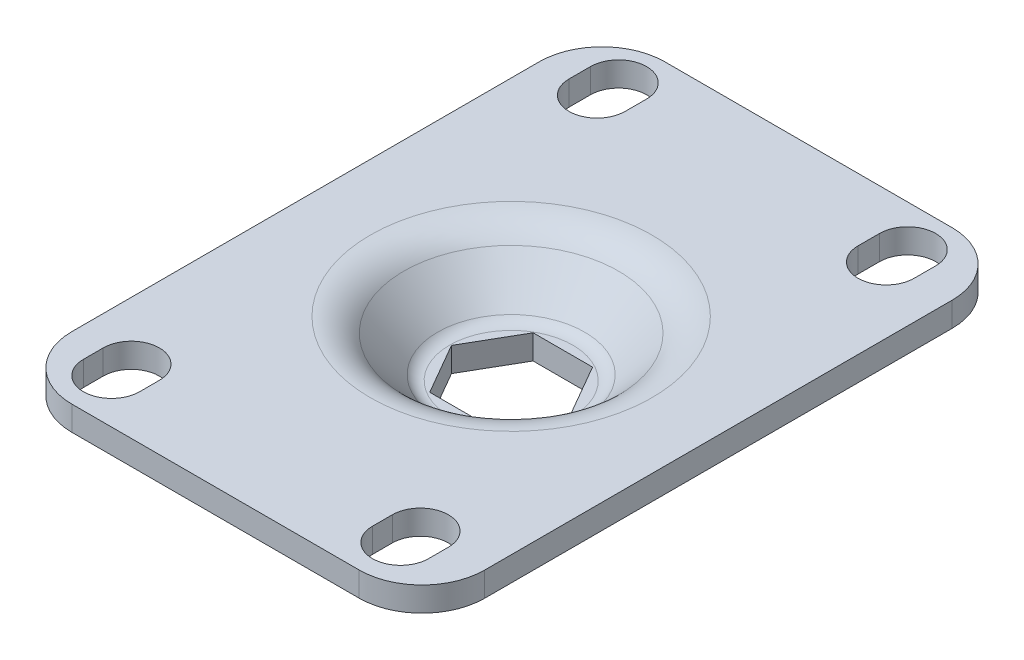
ISO-10303-21;
HEADER;
FILE_DESCRIPTION(('STEP AP214'),'2;1');
FILE_NAME('part.step','',(''),(''),'','','');
FILE_SCHEMA(('AUTOMOTIVE_DESIGN { 1 0 10303 214 1 1 1 1 }'));
ENDSEC;
DATA;
#1=APPLICATION_CONTEXT('core data for automotive mechanical design processes');
#2=APPLICATION_PROTOCOL_DEFINITION('international standard','automotive_design',2000,#1);
#3=PRODUCT_CONTEXT('',#1,'mechanical');
#4=PRODUCT('Part','Part','',(#3));
#5=PRODUCT_RELATED_PRODUCT_CATEGORY('part','',(#4));
#6=PRODUCT_DEFINITION_FORMATION('','',#4);
#7=PRODUCT_DEFINITION_CONTEXT('part definition',#1,'design');
#8=PRODUCT_DEFINITION('design','',#6,#7);
#9=PRODUCT_DEFINITION_SHAPE('','',#8);
#10=(LENGTH_UNIT() NAMED_UNIT(*) SI_UNIT(.MILLI.,.METRE.));
#11=(NAMED_UNIT(*) PLANE_ANGLE_UNIT() SI_UNIT($,.RADIAN.));
#12=(NAMED_UNIT(*) SI_UNIT($,.STERADIAN.) SOLID_ANGLE_UNIT());
#13=UNCERTAINTY_MEASURE_WITH_UNIT(LENGTH_MEASURE(1.E-05),#10,'distance_accuracy_value','');
#14=(GEOMETRIC_REPRESENTATION_CONTEXT(3) GLOBAL_UNCERTAINTY_ASSIGNED_CONTEXT((#13)) GLOBAL_UNIT_ASSIGNED_CONTEXT((#10,
#11,#12)) REPRESENTATION_CONTEXT('',''));
#15=CARTESIAN_POINT('',(0.,0.,0.));
#16=DIRECTION('',(0.,0.,1.));
#17=DIRECTION('',(1.,0.,0.));
#18=AXIS2_PLACEMENT_3D('',#15,#16,#17);
#19=CARTESIAN_POINT('',(9.46750689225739,0.,0.));
#20=DIRECTION('',(0.,-1.,0.));
#21=DIRECTION('',(0.,0.,-1.));
#22=AXIS2_PLACEMENT_3D('',#19,#20,#21);
#23=PLANE('',#22);
#24=DIRECTION('',(1.,0.,0.));
#25=VECTOR('',#24,1.);
#26=CARTESIAN_POINT('',(-4.70977858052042,0.,7.81482388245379));
#27=LINE('',#26,#25);
#28=CARTESIAN_POINT('',(4.47640557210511,0.,7.81482388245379));
#29=VERTEX_POINT('',#28);
#30=CARTESIAN_POINT('',(-4.70977858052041,0.,7.81482388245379));
#31=VERTEX_POINT('',#30);
#32=EDGE_CURVE('E735',#29,#31,#27,.F.);
#33=ORIENTED_EDGE('',*,*,#32,.T.);
#34=DIRECTION('',(0.500000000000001,0.,0.866025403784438));
#35=VECTOR('',#34,1.);
#36=CARTESIAN_POINT('',(-9.28212202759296,0.,-0.104707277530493));
#37=LINE('',#36,#35);
#38=CARTESIAN_POINT('',(-9.28212202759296,0.,-0.104707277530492));
#39=VERTEX_POINT('',#38);
#40=EDGE_CURVE('E240',#31,#39,#37,.F.);
#41=ORIENTED_EDGE('',*,*,#40,.T.);
#42=DIRECTION('',(-0.500000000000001,0.,0.866025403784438));
#43=VECTOR('',#42,1.);
#44=CARTESIAN_POINT('',(-4.68902995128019,0.,-8.06017611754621));
#45=LINE('',#44,#43);
#46=CARTESIAN_POINT('',(-4.68902995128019,0.,-8.06017611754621));
#47=VERTEX_POINT('',#46);
#48=EDGE_CURVE('E235',#39,#47,#45,.F.);
#49=ORIENTED_EDGE('',*,*,#48,.T.);
#50=DIRECTION('',(-1.,0.,0.));
#51=VECTOR('',#50,1.);
#52=CARTESIAN_POINT('',(4.45565694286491,0.,-8.06017611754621));
#53=LINE('',#52,#51);
#54=CARTESIAN_POINT('',(4.45565694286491,0.,-8.06017611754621));
#55=VERTEX_POINT('',#54);
#56=EDGE_CURVE('E225',#47,#55,#53,.F.);
#57=ORIENTED_EDGE('',*,*,#56,.T.);
#58=DIRECTION('',(-0.5,0.,-0.866025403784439));
#59=VECTOR('',#58,1.);
#60=CARTESIAN_POINT('',(9.04874901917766,0.,-0.104707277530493));
#61=LINE('',#60,#59);
#62=CARTESIAN_POINT('',(9.04874901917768,0.,-0.104707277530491));
#63=VERTEX_POINT('',#62);
#64=EDGE_CURVE('E249',#55,#63,#61,.F.);
#65=ORIENTED_EDGE('',*,*,#64,.T.);
#66=DIRECTION('',(0.5,0.,-0.866025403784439));
#67=VECTOR('',#66,1.);
#68=CARTESIAN_POINT('',(4.47640557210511,0.,7.81482388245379));
#69=LINE('',#68,#67);
#70=EDGE_CURVE('E740',#63,#29,#69,.F.);
#71=ORIENTED_EDGE('',*,*,#70,.T.);
#72=EDGE_LOOP('',(#33,#41,#49,#57,#65,#71));
#73=FACE_BOUND('',#72,.T.);
#74=CARTESIAN_POINT('',(0.,0.,0.));
#75=DIRECTION('',(0.,-1.,0.));
#76=DIRECTION('',(-1.,0.,0.));
#77=AXIS2_PLACEMENT_3D('',#74,#75,#76);
#78=CIRCLE('',#77,9.46750689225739);
#79=CARTESIAN_POINT('',(-9.46750689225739,0.,0.));
#80=VERTEX_POINT('',#79);
#81=EDGE_CURVE('E244',#80,#80,#78,.F.);
#82=ORIENTED_EDGE('',*,*,#81,.T.);
#83=EDGE_LOOP('',(#82));
#84=FACE_BOUND('',#83,.T.);
#85=ADVANCED_FACE('F16',(#73,#84),#23,.F.);
#86=CARTESIAN_POINT('',(0.,2.54,0.));
#87=DIRECTION('',(0.,1.,0.));
#88=DIRECTION('',(0.,0.,1.));
#89=AXIS2_PLACEMENT_3D('',#86,#87,#88);
#90=TOROIDAL_SURFACE('',#89,9.46750689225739,2.54);
#91=CARTESIAN_POINT('',(0.,0.800927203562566,0.));
#92=DIRECTION('',(0.,1.,0.));
#93=DIRECTION('',(-1.,0.,0.));
#94=AXIS2_PLACEMENT_3D('',#91,#92,#93);
#95=CIRCLE('',#94,11.3187837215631);
#96=CARTESIAN_POINT('',(-11.3187837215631,0.800927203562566,0.));
#97=VERTEX_POINT('',#96);
#98=EDGE_CURVE('E718',#97,#97,#95,.T.);
#99=ORIENTED_EDGE('',*,*,#98,.T.);
#100=EDGE_LOOP('',(#99));
#101=FACE_BOUND('',#100,.T.);
#102=ORIENTED_EDGE('',*,*,#81,.F.);
#103=EDGE_LOOP('',(#102));
#104=FACE_BOUND('',#103,.T.);
#105=ADVANCED_FACE('F258',(#101,#104),#90,.F.);
#106=CARTESIAN_POINT('',(-4.68902995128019,8.55980011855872,-8.06017611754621));
#107=DIRECTION('',(-0.866025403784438,0.,-0.500000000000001));
#108=DIRECTION('',(-0.500000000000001,0.,0.866025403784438));
#109=AXIS2_PLACEMENT_3D('',#106,#107,#108);
#110=PLANE('',#109);
#111=DIRECTION('',(0.500000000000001,0.,-0.866025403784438));
#112=VECTOR('',#111,1.);
#113=CARTESIAN_POINT('',(-9.28212202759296,-3.75919988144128,-0.104707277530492));
#114=LINE('',#113,#112);
#115=CARTESIAN_POINT('',(-9.28212202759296,-3.75919988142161,-0.104707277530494));
#116=VERTEX_POINT('',#115);
#117=CARTESIAN_POINT('',(-4.68902995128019,-3.75919988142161,-8.06017611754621));
#118=VERTEX_POINT('',#117);
#119=EDGE_CURVE('E248',#116,#118,#114,.T.);
#120=ORIENTED_EDGE('',*,*,#119,.T.);
#121=DIRECTION('',(0.,1.,0.));
#122=VECTOR('',#121,1.);
#123=CARTESIAN_POINT('',(-4.68902995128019,8.55980011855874,-8.06017611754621));
#124=LINE('',#123,#122);
#125=EDGE_CURVE('E230',#118,#47,#124,.T.);
#126=ORIENTED_EDGE('',*,*,#125,.T.);
#127=ORIENTED_EDGE('',*,*,#48,.F.);
#128=DIRECTION('',(0.,1.,0.));
#129=VECTOR('',#128,1.);
#130=CARTESIAN_POINT('',(-9.28212202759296,8.55980011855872,-0.104707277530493));
#131=LINE('',#130,#129);
#132=EDGE_CURVE('E729',#39,#116,#131,.F.);
#133=ORIENTED_EDGE('',*,*,#132,.T.);
#134=EDGE_LOOP('',(#120,#126,#127,#133));
#135=FACE_BOUND('',#134,.T.);
#136=ADVANCED_FACE('F247',(#135),#110,.F.);
#137=CARTESIAN_POINT('',(4.45565694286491,8.55980011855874,-8.06017611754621));
#138=DIRECTION('',(0.,0.,-1.));
#139=DIRECTION('',(-1.,0.,0.));
#140=AXIS2_PLACEMENT_3D('',#137,#138,#139);
#141=PLANE('',#140);
#142=DIRECTION('',(1.,0.,0.));
#143=VECTOR('',#142,1.);
#144=CARTESIAN_POINT('',(4.87651302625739,-3.75919988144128,-8.06017611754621));
#145=LINE('',#144,#143);
#146=CARTESIAN_POINT('',(4.45565694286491,-3.75919988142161,-8.06017611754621));
#147=VERTEX_POINT('',#146);
#148=EDGE_CURVE('E753',#118,#147,#145,.T.);
#149=ORIENTED_EDGE('',*,*,#148,.T.);
#150=DIRECTION('',(0.,1.,0.));
#151=VECTOR('',#150,1.);
#152=CARTESIAN_POINT('',(4.45565694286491,8.55980011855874,-8.06017611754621));
#153=LINE('',#152,#151);
#154=EDGE_CURVE('E232',#147,#55,#153,.T.);
#155=ORIENTED_EDGE('',*,*,#154,.T.);
#156=ORIENTED_EDGE('',*,*,#56,.F.);
#157=ORIENTED_EDGE('',*,*,#125,.F.);
#158=EDGE_LOOP('',(#149,#155,#156,#157));
#159=FACE_BOUND('',#158,.T.);
#160=ADVANCED_FACE('F228',(#159),#141,.F.);
#161=CARTESIAN_POINT('',(9.04874901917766,8.55980011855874,-0.104707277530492));
#162=DIRECTION('',(0.866025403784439,0.,-0.5));
#163=DIRECTION('',(-0.5,0.,-0.866025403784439));
#164=AXIS2_PLACEMENT_3D('',#161,#162,#163);
#165=PLANE('',#164);
#166=DIRECTION('',(0.500000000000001,0.,0.866025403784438));
#167=VECTOR('',#166,1.);
#168=CARTESIAN_POINT('',(4.45565694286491,-3.75919988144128,-8.06017611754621));
#169=LINE('',#168,#167);
#170=CARTESIAN_POINT('',(9.04874901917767,-3.75919988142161,-0.104707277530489));
#171=VERTEX_POINT('',#170);
#172=EDGE_CURVE('E750',#147,#171,#169,.T.);
#173=ORIENTED_EDGE('',*,*,#172,.T.);
#174=DIRECTION('',(0.,1.,0.));
#175=VECTOR('',#174,1.);
#176=CARTESIAN_POINT('',(9.04874901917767,8.55980011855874,-0.104707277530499));
#177=LINE('',#176,#175);
#178=EDGE_CURVE('E737',#171,#63,#177,.T.);
#179=ORIENTED_EDGE('',*,*,#178,.T.);
#180=ORIENTED_EDGE('',*,*,#64,.F.);
#181=ORIENTED_EDGE('',*,*,#154,.F.);
#182=EDGE_LOOP('',(#173,#179,#180,#181));
#183=FACE_BOUND('',#182,.T.);
#184=ADVANCED_FACE('F472',(#183),#165,.F.);
#185=CARTESIAN_POINT('',(4.47640557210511,8.55980011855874,7.81482388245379));
#186=DIRECTION('',(0.866025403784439,0.,0.5));
#187=DIRECTION('',(0.5,0.,-0.866025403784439));
#188=AXIS2_PLACEMENT_3D('',#185,#186,#187);
#189=PLANE('',#188);
#190=DIRECTION('',(-0.500000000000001,0.,0.866025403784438));
#191=VECTOR('',#190,1.);
#192=CARTESIAN_POINT('',(9.04874901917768,-3.75919988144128,-0.104707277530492));
#193=LINE('',#192,#191);
#194=CARTESIAN_POINT('',(4.47640557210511,-3.75919988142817,7.81482388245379));
#195=VERTEX_POINT('',#194);
#196=EDGE_CURVE('E744',#171,#195,#193,.T.);
#197=ORIENTED_EDGE('',*,*,#196,.T.);
#198=DIRECTION('',(0.,1.,0.));
#199=VECTOR('',#198,1.);
#200=CARTESIAN_POINT('',(4.47640557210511,8.55980011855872,7.81482388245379));
#201=LINE('',#200,#199);
#202=EDGE_CURVE('E732',#195,#29,#201,.T.);
#203=ORIENTED_EDGE('',*,*,#202,.T.);
#204=ORIENTED_EDGE('',*,*,#70,.F.);
#205=ORIENTED_EDGE('',*,*,#178,.F.);
#206=EDGE_LOOP('',(#197,#203,#204,#205));
#207=FACE_BOUND('',#206,.T.);
#208=ADVANCED_FACE('F468',(#207),#189,.F.);
#209=CARTESIAN_POINT('',(-4.70977858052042,8.55980011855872,7.81482388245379));
#210=DIRECTION('',(0.,0.,1.));
#211=DIRECTION('',(1.,0.,0.));
#212=AXIS2_PLACEMENT_3D('',#209,#210,#211);
#213=PLANE('',#212);
#214=DIRECTION('',(1.,0.,0.));
#215=VECTOR('',#214,1.);
#216=CARTESIAN_POINT('',(4.87651302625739,-3.75919988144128,7.81482388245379));
#217=LINE('',#216,#215);
#218=CARTESIAN_POINT('',(-4.70977858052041,-3.75919988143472,7.81482388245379));
#219=VERTEX_POINT('',#218);
#220=EDGE_CURVE('E747',#195,#219,#217,.F.);
#221=ORIENTED_EDGE('',*,*,#220,.T.);
#222=DIRECTION('',(0.,1.,0.));
#223=VECTOR('',#222,1.);
#224=CARTESIAN_POINT('',(-4.7097785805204,8.55980011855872,7.81482388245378));
#225=LINE('',#224,#223);
#226=EDGE_CURVE('E190',#219,#31,#225,.T.);
#227=ORIENTED_EDGE('',*,*,#226,.T.);
#228=ORIENTED_EDGE('',*,*,#32,.F.);
#229=ORIENTED_EDGE('',*,*,#202,.F.);
#230=EDGE_LOOP('',(#221,#227,#228,#229));
#231=FACE_BOUND('',#230,.T.);
#232=ADVANCED_FACE('F465',(#231),#213,.F.);
#233=CARTESIAN_POINT('',(-9.28212202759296,8.55980011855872,-0.104707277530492));
#234=DIRECTION('',(-0.866025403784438,0.,0.500000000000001));
#235=DIRECTION('',(0.500000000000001,0.,0.866025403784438));
#236=AXIS2_PLACEMENT_3D('',#233,#234,#235);
#237=PLANE('',#236);
#238=DIRECTION('',(-0.499999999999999,0.,-0.866025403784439));
#239=VECTOR('',#238,1.);
#240=CARTESIAN_POINT('',(-4.70977858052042,-3.75919988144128,7.81482388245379));
#241=LINE('',#240,#239);
#242=EDGE_CURVE('E427',#219,#116,#241,.T.);
#243=ORIENTED_EDGE('',*,*,#242,.T.);
#244=ORIENTED_EDGE('',*,*,#132,.F.);
#245=ORIENTED_EDGE('',*,*,#40,.F.);
#246=ORIENTED_EDGE('',*,*,#226,.F.);
#247=EDGE_LOOP('',(#243,#244,#245,#246));
#248=FACE_BOUND('',#247,.T.);
#249=ADVANCED_FACE('F461',(#248),#237,.F.);
#250=CARTESIAN_POINT('',(0.,6.33322245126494,0.));
#251=DIRECTION('',(0.,1.,0.));
#252=DIRECTION('',(0.,0.,1.));
#253=AXIS2_PLACEMENT_3D('',#250,#251,#252);
#254=CONICAL_SURFACE('',#253,16.5157720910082,0.754156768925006);
#255=CARTESIAN_POINT('',(0.,6.33322245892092,0.));
#256=DIRECTION('',(0.,1.,0.));
#257=DIRECTION('',(0.,0.,1.));
#258=AXIS2_PLACEMENT_3D('',#255,#256,#257);
#259=CIRCLE('',#258,16.5157720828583);
#260=CARTESIAN_POINT('',(0.,6.33322245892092,16.5157720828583));
#261=VERTEX_POINT('',#260);
#262=EDGE_CURVE('E423',#261,#261,#259,.F.);
#263=ORIENTED_EDGE('',*,*,#262,.F.);
#264=EDGE_LOOP('',(#263));
#265=FACE_BOUND('',#264,.T.);
#266=ORIENTED_EDGE('',*,*,#98,.F.);
#267=EDGE_LOOP('',(#266));
#268=FACE_BOUND('',#267,.T.);
#269=ADVANCED_FACE('F457',(#265,#268),#254,.F.);
#270=CARTESIAN_POINT('',(4.87651302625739,-3.75919988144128,0.));
#271=DIRECTION('',(0.,1.,0.));
#272=DIRECTION('',(0.,0.,1.));
#273=AXIS2_PLACEMENT_3D('',#270,#271,#272);
#274=PLANE('',#273);
#275=ORIENTED_EDGE('',*,*,#220,.F.);
#276=ORIENTED_EDGE('',*,*,#196,.F.);
#277=ORIENTED_EDGE('',*,*,#172,.F.);
#278=ORIENTED_EDGE('',*,*,#148,.F.);
#279=ORIENTED_EDGE('',*,*,#119,.F.);
#280=ORIENTED_EDGE('',*,*,#242,.F.);
#281=EDGE_LOOP('',(#275,#276,#277,#278,#279,#280));
#282=FACE_BOUND('',#281,.T.);
#283=CARTESIAN_POINT('',(0.,-3.75919988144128,0.));
#284=DIRECTION('',(0.,1.,0.));
#285=DIRECTION('',(-1.,0.,0.));
#286=AXIS2_PLACEMENT_3D('',#283,#284,#285);
#287=CIRCLE('',#286,11.0938686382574);
#288=CARTESIAN_POINT('',(-11.0938686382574,-3.75919988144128,0.));
#289=VERTEX_POINT('',#288);
#290=EDGE_CURVE('E426',#289,#289,#287,.T.);
#291=ORIENTED_EDGE('',*,*,#290,.F.);
#292=EDGE_LOOP('',(#291));
#293=FACE_BOUND('',#292,.T.);
#294=ADVANCED_FACE('F448',(#282,#293),#274,.F.);
#295=CARTESIAN_POINT('',(0.,1.49860011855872,0.));
#296=DIRECTION('',(0.,1.,0.));
#297=DIRECTION('',(0.,0.,1.));
#298=AXIS2_PLACEMENT_3D('',#295,#296,#297);
#299=TOROIDAL_SURFACE('',#298,21.6623216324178,7.0612);
#300=ORIENTED_EDGE('',*,*,#262,.T.);
#301=EDGE_LOOP('',(#300));
#302=FACE_BOUND('',#301,.T.);
#303=CARTESIAN_POINT('',(0.,8.55980011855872,0.));
#304=DIRECTION('',(0.,1.,0.));
#305=DIRECTION('',(-1.,0.,0.));
#306=AXIS2_PLACEMENT_3D('',#303,#304,#305);
#307=CIRCLE('',#306,21.6623216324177);
#308=CARTESIAN_POINT('',(-21.6623216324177,8.55980011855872,0.));
#309=VERTEX_POINT('',#308);
#310=EDGE_CURVE('E379',#309,#309,#307,.T.);
#311=ORIENTED_EDGE('',*,*,#310,.T.);
#312=EDGE_LOOP('',(#311));
#313=FACE_BOUND('',#312,.T.);
#314=ADVANCED_FACE('F413',(#302,#313),#299,.T.);
#315=CARTESIAN_POINT('',(0.,-1.21919988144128,0.));
#316=DIRECTION('',(0.,1.,0.));
#317=DIRECTION('',(0.,0.,1.));
#318=AXIS2_PLACEMENT_3D('',#315,#316,#317);
#319=TOROIDAL_SURFACE('',#318,11.0938686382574,2.54);
#320=CARTESIAN_POINT('',(0.,-2.9582726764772,0.));
#321=DIRECTION('',(0.,1.,0.));
#322=DIRECTION('',(-1.,0.,0.));
#323=AXIS2_PLACEMENT_3D('',#320,#321,#322);
#324=CIRCLE('',#323,12.9451454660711);
#325=CARTESIAN_POINT('',(-12.9451454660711,-2.9582726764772,0.));
#326=VERTEX_POINT('',#325);
#327=EDGE_CURVE('E375',#326,#326,#324,.T.);
#328=ORIENTED_EDGE('',*,*,#327,.F.);
#329=EDGE_LOOP('',(#328));
#330=FACE_BOUND('',#329,.T.);
#331=ORIENTED_EDGE('',*,*,#290,.T.);
#332=EDGE_LOOP('',(#331));
#333=FACE_BOUND('',#332,.T.);
#334=ADVANCED_FACE('F407',(#330,#333),#319,.T.);
#335=CARTESIAN_POINT('',(21.6623216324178,8.55980011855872,0.));
#336=DIRECTION('',(0.,-1.,0.));
#337=DIRECTION('',(0.,0.,-1.));
#338=AXIS2_PLACEMENT_3D('',#335,#336,#337);
#339=PLANE('',#338);
#340=ORIENTED_EDGE('',*,*,#310,.F.);
#341=EDGE_LOOP('',(#340));
#342=FACE_BOUND('',#341,.T.);
#343=CARTESIAN_POINT('',(21.5974591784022,8.55980011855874,35.5644755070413));
#344=DIRECTION('',(0.,-1.,0.));
#345=DIRECTION('',(0.,0.,-1.));
#346=AXIS2_PLACEMENT_3D('',#343,#344,#345);
#347=CIRCLE('',#346,4.318);
#348=CARTESIAN_POINT('',(17.2794591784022,8.55980011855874,35.5644755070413));
#349=VERTEX_POINT('',#348);
#350=CARTESIAN_POINT('',(25.9154591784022,8.55980011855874,35.5644755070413));
#351=VERTEX_POINT('',#350);
#352=EDGE_CURVE('E322',#349,#351,#347,.T.);
#353=ORIENTED_EDGE('',*,*,#352,.T.);
#354=DIRECTION('',(0.,0.,-1.));
#355=VECTOR('',#354,1.);
#356=CARTESIAN_POINT('',(25.9154591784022,8.55980011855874,35.5644755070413));
#357=LINE('',#356,#355);
#358=CARTESIAN_POINT('',(25.9154591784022,8.55980011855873,38.6124755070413));
#359=VERTEX_POINT('',#358);
#360=EDGE_CURVE('E382',#351,#359,#357,.F.);
#361=ORIENTED_EDGE('',*,*,#360,.T.);
#362=CARTESIAN_POINT('',(21.5974591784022,8.55980011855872,38.6124755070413));
#363=DIRECTION('',(0.,-1.,0.));
#364=DIRECTION('',(0.,0.,-1.));
#365=AXIS2_PLACEMENT_3D('',#362,#363,#364);
#366=CIRCLE('',#365,4.318);
#367=CARTESIAN_POINT('',(17.2794591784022,8.55980011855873,38.6124755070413));
#368=VERTEX_POINT('',#367);
#369=EDGE_CURVE('E325',#359,#368,#366,.T.);
#370=ORIENTED_EDGE('',*,*,#369,.T.);
#371=DIRECTION('',(0.,0.,1.));
#372=VECTOR('',#371,1.);
#373=CARTESIAN_POINT('',(17.2794591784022,8.55980011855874,35.5644755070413));
#374=LINE('',#373,#372);
#375=EDGE_CURVE('E394',#368,#349,#374,.F.);
#376=ORIENTED_EDGE('',*,*,#375,.T.);
#377=EDGE_LOOP('',(#353,#361,#370,#376));
#378=FACE_BOUND('',#377,.T.);
#379=CARTESIAN_POINT('',(-22.8525408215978,8.55980011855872,35.5644755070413));
#380=DIRECTION('',(0.,-1.,0.));
#381=DIRECTION('',(0.,0.,-1.));
#382=AXIS2_PLACEMENT_3D('',#379,#380,#381);
#383=CIRCLE('',#382,4.318);
#384=CARTESIAN_POINT('',(-27.1705408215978,8.55980011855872,35.5644755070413));
#385=VERTEX_POINT('',#384);
#386=CARTESIAN_POINT('',(-18.5345408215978,8.55980011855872,35.5644755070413));
#387=VERTEX_POINT('',#386);
#388=EDGE_CURVE('E329',#385,#387,#383,.T.);
#389=ORIENTED_EDGE('',*,*,#388,.T.);
#390=DIRECTION('',(0.,0.,-1.));
#391=VECTOR('',#390,1.);
#392=CARTESIAN_POINT('',(-18.5345408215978,8.55980011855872,35.5644755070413));
#393=LINE('',#392,#391);
#394=CARTESIAN_POINT('',(-18.5345408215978,8.55980011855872,38.6124755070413));
#395=VERTEX_POINT('',#394);
#396=EDGE_CURVE('E555',#387,#395,#393,.F.);
#397=ORIENTED_EDGE('',*,*,#396,.T.);
#398=CARTESIAN_POINT('',(-22.8525408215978,8.55980011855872,38.6124755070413));
#399=DIRECTION('',(0.,-1.,0.));
#400=DIRECTION('',(0.,0.,-1.));
#401=AXIS2_PLACEMENT_3D('',#398,#399,#400);
#402=CIRCLE('',#401,4.318);
#403=CARTESIAN_POINT('',(-27.1705408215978,8.55980011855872,38.6124755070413));
#404=VERTEX_POINT('',#403);
#405=EDGE_CURVE('E333',#395,#404,#402,.T.);
#406=ORIENTED_EDGE('',*,*,#405,.T.);
#407=DIRECTION('',(0.,0.,1.));
#408=VECTOR('',#407,1.);
#409=CARTESIAN_POINT('',(-27.1705408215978,8.55980011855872,35.5644755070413));
#410=LINE('',#409,#408);
#411=EDGE_CURVE('E560',#404,#385,#410,.F.);
#412=ORIENTED_EDGE('',*,*,#411,.T.);
#413=EDGE_LOOP('',(#389,#397,#406,#412));
#414=FACE_BOUND('',#413,.T.);
#415=CARTESIAN_POINT('',(-22.8525408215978,8.55980011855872,-39.3655244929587));
#416=DIRECTION('',(0.,-1.,0.));
#417=DIRECTION('',(0.,0.,-1.));
#418=AXIS2_PLACEMENT_3D('',#415,#416,#417);
#419=CIRCLE('',#418,4.318);
#420=CARTESIAN_POINT('',(-27.1705408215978,8.55980011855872,-39.3655244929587));
#421=VERTEX_POINT('',#420);
#422=CARTESIAN_POINT('',(-18.5345408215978,8.55980011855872,-39.3655244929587));
#423=VERTEX_POINT('',#422);
#424=EDGE_CURVE('E337',#421,#423,#419,.T.);
#425=ORIENTED_EDGE('',*,*,#424,.T.);
#426=DIRECTION('',(0.,0.,-1.));
#427=VECTOR('',#426,1.);
#428=CARTESIAN_POINT('',(-18.5345408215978,8.55980011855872,-39.3655244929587));
#429=LINE('',#428,#427);
#430=CARTESIAN_POINT('',(-18.5345408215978,8.55980011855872,-36.0635244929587));
#431=VERTEX_POINT('',#430);
#432=EDGE_CURVE('E565',#423,#431,#429,.F.);
#433=ORIENTED_EDGE('',*,*,#432,.T.);
#434=CARTESIAN_POINT('',(-22.8525408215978,8.55980011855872,-36.0635244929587));
#435=DIRECTION('',(0.,-1.,0.));
#436=DIRECTION('',(0.,0.,-1.));
#437=AXIS2_PLACEMENT_3D('',#434,#435,#436);
#438=CIRCLE('',#437,4.318);
#439=CARTESIAN_POINT('',(-27.1705408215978,8.55980011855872,-36.0635244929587));
#440=VERTEX_POINT('',#439);
#441=EDGE_CURVE('E341',#431,#440,#438,.T.);
#442=ORIENTED_EDGE('',*,*,#441,.T.);
#443=DIRECTION('',(0.,0.,1.));
#444=VECTOR('',#443,1.);
#445=CARTESIAN_POINT('',(-27.1705408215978,8.55980011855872,-39.3655244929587));
#446=LINE('',#445,#444);
#447=EDGE_CURVE('E570',#440,#421,#446,.F.);
#448=ORIENTED_EDGE('',*,*,#447,.T.);
#449=EDGE_LOOP('',(#425,#433,#442,#448));
#450=FACE_BOUND('',#449,.T.);
#451=CARTESIAN_POINT('',(21.5974591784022,8.55980011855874,-39.3655244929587));
#452=DIRECTION('',(0.,-1.,0.));
#453=DIRECTION('',(0.,0.,-1.));
#454=AXIS2_PLACEMENT_3D('',#451,#452,#453);
#455=CIRCLE('',#454,4.318);
#456=CARTESIAN_POINT('',(17.2794591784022,8.55980011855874,-39.3655244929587));
#457=VERTEX_POINT('',#456);
#458=CARTESIAN_POINT('',(25.9154591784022,8.55980011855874,-39.3655244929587));
#459=VERTEX_POINT('',#458);
#460=EDGE_CURVE('E345',#457,#459,#455,.T.);
#461=ORIENTED_EDGE('',*,*,#460,.T.);
#462=DIRECTION('',(0.,0.,-1.));
#463=VECTOR('',#462,1.);
#464=CARTESIAN_POINT('',(25.9154591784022,8.55980011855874,-39.3655244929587));
#465=LINE('',#464,#463);
#466=CARTESIAN_POINT('',(25.9154591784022,8.55980011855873,-36.0635244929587));
#467=VERTEX_POINT('',#466);
#468=EDGE_CURVE('E575',#459,#467,#465,.F.);
#469=ORIENTED_EDGE('',*,*,#468,.T.);
#470=CARTESIAN_POINT('',(21.5974591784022,8.55980011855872,-36.0635244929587));
#471=DIRECTION('',(0.,-1.,0.));
#472=DIRECTION('',(0.,0.,-1.));
#473=AXIS2_PLACEMENT_3D('',#470,#471,#472);
#474=CIRCLE('',#473,4.318);
#475=CARTESIAN_POINT('',(17.2794591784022,8.55980011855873,-36.0635244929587));
#476=VERTEX_POINT('',#475);
#477=EDGE_CURVE('E349',#467,#476,#474,.T.);
#478=ORIENTED_EDGE('',*,*,#477,.T.);
#479=DIRECTION('',(0.,0.,1.));
#480=VECTOR('',#479,1.);
#481=CARTESIAN_POINT('',(17.2794591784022,8.55980011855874,-39.3655244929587));
#482=LINE('',#481,#480);
#483=EDGE_CURVE('E580',#476,#457,#482,.F.);
#484=ORIENTED_EDGE('',*,*,#483,.T.);
#485=EDGE_LOOP('',(#461,#469,#478,#484));
#486=FACE_BOUND('',#485,.T.);
#487=DIRECTION('',(-1.,0.,0.));
#488=VECTOR('',#487,1.);
#489=CARTESIAN_POINT('',(22.0979999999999,8.55980011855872,-45.72));
#490=LINE('',#489,#488);
#491=CARTESIAN_POINT('',(-22.098,8.55980011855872,-45.72));
#492=VERTEX_POINT('',#491);
#493=CARTESIAN_POINT('',(22.098,8.55980011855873,-45.72));
#494=VERTEX_POINT('',#493);
#495=EDGE_CURVE('E378',#492,#494,#490,.F.);
#496=ORIENTED_EDGE('',*,*,#495,.F.);
#497=CARTESIAN_POINT('',(-22.098,8.55980011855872,-36.068));
#498=DIRECTION('',(0.,-1.,0.));
#499=DIRECTION('',(0.,0.,-1.));
#500=AXIS2_PLACEMENT_3D('',#497,#498,#499);
#501=CIRCLE('',#500,9.652);
#502=CARTESIAN_POINT('',(-31.75,8.55980011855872,-36.068));
#503=VERTEX_POINT('',#502);
#504=EDGE_CURVE('E20',#503,#492,#501,.T.);
#505=ORIENTED_EDGE('',*,*,#504,.F.);
#506=DIRECTION('',(0.,0.,1.));
#507=VECTOR('',#506,1.);
#508=CARTESIAN_POINT('',(-31.75,8.55980011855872,-36.068));
#509=LINE('',#508,#507);
#510=CARTESIAN_POINT('',(-31.75,8.55980011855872,35.814));
#511=VERTEX_POINT('',#510);
#512=EDGE_CURVE('E176',#511,#503,#509,.F.);
#513=ORIENTED_EDGE('',*,*,#512,.F.);
#514=CARTESIAN_POINT('',(-22.098,8.55980011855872,35.814));
#515=DIRECTION('',(0.,-1.,0.));
#516=DIRECTION('',(0.,0.,-1.));
#517=AXIS2_PLACEMENT_3D('',#514,#515,#516);
#518=CIRCLE('',#517,9.652);
#519=CARTESIAN_POINT('',(-22.098,8.55980011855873,45.466));
#520=VERTEX_POINT('',#519);
#521=EDGE_CURVE('E359',#520,#511,#518,.T.);
#522=ORIENTED_EDGE('',*,*,#521,.F.);
#523=DIRECTION('',(1.,0.,0.));
#524=VECTOR('',#523,1.);
#525=CARTESIAN_POINT('',(22.0979999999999,8.55980011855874,45.466));
#526=LINE('',#525,#524);
#527=CARTESIAN_POINT('',(22.098,8.55980011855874,45.466));
#528=VERTEX_POINT('',#527);
#529=EDGE_CURVE('E365',#528,#520,#526,.F.);
#530=ORIENTED_EDGE('',*,*,#529,.F.);
#531=CARTESIAN_POINT('',(22.098,8.55980011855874,35.814));
#532=DIRECTION('',(0.,-1.,0.));
#533=DIRECTION('',(0.,0.,-1.));
#534=AXIS2_PLACEMENT_3D('',#531,#532,#533);
#535=CIRCLE('',#534,9.652);
#536=CARTESIAN_POINT('',(31.75,8.55980011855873,35.814));
#537=VERTEX_POINT('',#536);
#538=EDGE_CURVE('E356',#537,#528,#535,.T.);
#539=ORIENTED_EDGE('',*,*,#538,.F.);
#540=DIRECTION('',(0.,0.,-1.));
#541=VECTOR('',#540,1.);
#542=CARTESIAN_POINT('',(31.75,8.55980011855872,-36.068));
#543=LINE('',#542,#541);
#544=CARTESIAN_POINT('',(31.75,8.55980011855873,-36.068));
#545=VERTEX_POINT('',#544);
#546=EDGE_CURVE('E588',#545,#537,#543,.F.);
#547=ORIENTED_EDGE('',*,*,#546,.F.);
#548=CARTESIAN_POINT('',(22.098,8.55980011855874,-36.068));
#549=DIRECTION('',(0.,-1.,0.));
#550=DIRECTION('',(0.,0.,-1.));
#551=AXIS2_PLACEMENT_3D('',#548,#549,#550);
#552=CIRCLE('',#551,9.652);
#553=EDGE_CURVE('E353',#494,#545,#552,.T.);
#554=ORIENTED_EDGE('',*,*,#553,.F.);
#555=EDGE_LOOP('',(#496,#505,#513,#522,#530,#539,#547,#554));
#556=FACE_BOUND('',#555,.T.);
#557=ADVANCED_FACE('F396',(#342,#378,#414,#450,#486,#556),#339,.F.);
#558=CARTESIAN_POINT('',(0.,3.9996728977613,0.));
#559=DIRECTION('',(0.,1.,0.));
#560=DIRECTION('',(0.,0.,1.));
#561=AXIS2_PLACEMENT_3D('',#558,#559,#560);
#562=CONICAL_SURFACE('',#561,19.481376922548,0.754156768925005);
#563=CARTESIAN_POINT('',(0.,3.99967290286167,0.));
#564=DIRECTION('',(0.,1.,0.));
#565=DIRECTION('',(0.,0.,1.));
#566=AXIS2_PLACEMENT_3D('',#563,#564,#565);
#567=CIRCLE('',#566,19.4813769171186);
#568=CARTESIAN_POINT('',(0.,3.99967290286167,19.4813769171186));
#569=VERTEX_POINT('',#568);
#570=EDGE_CURVE('E529',#569,#569,#567,.F.);
#571=ORIENTED_EDGE('',*,*,#570,.T.);
#572=EDGE_LOOP('',(#571));
#573=FACE_BOUND('',#572,.T.);
#574=ORIENTED_EDGE('',*,*,#327,.T.);
#575=EDGE_LOOP('',(#574));
#576=FACE_BOUND('',#575,.T.);
#577=ADVANCED_FACE('F406',(#573,#576),#562,.T.);
#578=CARTESIAN_POINT('',(22.0979999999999,8.55980011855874,-45.72));
#579=DIRECTION('',(0.,0.,-1.));
#580=DIRECTION('',(-1.,0.,0.));
#581=AXIS2_PLACEMENT_3D('',#578,#579,#580);
#582=PLANE('',#581);
#583=ORIENTED_EDGE('',*,*,#495,.T.);
#584=DIRECTION('',(0.,-1.,0.));
#585=VECTOR('',#584,1.);
#586=CARTESIAN_POINT('',(22.098,8.55980011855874,-45.72));
#587=LINE('',#586,#585);
#588=CARTESIAN_POINT('',(22.098,4.80060011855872,-45.72));
#589=VERTEX_POINT('',#588);
#590=EDGE_CURVE('E355',#589,#494,#587,.F.);
#591=ORIENTED_EDGE('',*,*,#590,.F.);
#592=DIRECTION('',(1.,0.,0.));
#593=VECTOR('',#592,1.);
#594=CARTESIAN_POINT('',(21.3326537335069,4.80060011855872,-45.72));
#595=LINE('',#594,#593);
#596=CARTESIAN_POINT('',(-22.098,4.80060011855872,-45.72));
#597=VERTEX_POINT('',#596);
#598=EDGE_CURVE('E321',#589,#597,#595,.F.);
#599=ORIENTED_EDGE('',*,*,#598,.T.);
#600=DIRECTION('',(0.,-1.,0.));
#601=VECTOR('',#600,1.);
#602=CARTESIAN_POINT('',(-22.098,8.55980011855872,-45.72));
#603=LINE('',#602,#601);
#604=EDGE_CURVE('E370',#492,#597,#603,.T.);
#605=ORIENTED_EDGE('',*,*,#604,.F.);
#606=EDGE_LOOP('',(#583,#591,#599,#605));
#607=FACE_BOUND('',#606,.T.);
#608=ADVANCED_FACE('F685',(#607),#582,.T.);
#609=CARTESIAN_POINT('',(-22.098,8.55980011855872,-36.068));
#610=DIRECTION('',(0.,-1.,0.));
#611=DIRECTION('',(0.,0.,-1.));
#612=AXIS2_PLACEMENT_3D('',#609,#610,#611);
#613=CYLINDRICAL_SURFACE('',#612,9.652);
#614=ORIENTED_EDGE('',*,*,#504,.T.);
#615=ORIENTED_EDGE('',*,*,#604,.T.);
#616=CARTESIAN_POINT('',(-22.098,4.80060011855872,-36.068));
#617=DIRECTION('',(0.,-1.,0.));
#618=DIRECTION('',(0.,0.,-1.));
#619=AXIS2_PLACEMENT_3D('',#616,#617,#618);
#620=CIRCLE('',#619,9.652);
#621=CARTESIAN_POINT('',(-31.75,4.80060011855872,-36.068));
#622=VERTEX_POINT('',#621);
#623=EDGE_CURVE('E318',#597,#622,#620,.F.);
#624=ORIENTED_EDGE('',*,*,#623,.T.);
#625=DIRECTION('',(0.,1.,0.));
#626=VECTOR('',#625,1.);
#627=CARTESIAN_POINT('',(-31.75,8.55980011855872,-36.068));
#628=LINE('',#627,#626);
#629=EDGE_CURVE('E361',#503,#622,#628,.F.);
#630=ORIENTED_EDGE('',*,*,#629,.F.);
#631=EDGE_LOOP('',(#614,#615,#624,#630));
#632=FACE_BOUND('',#631,.T.);
#633=ADVANCED_FACE('F683',(#632),#613,.T.);
#634=CARTESIAN_POINT('',(-31.75,8.55980011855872,-36.068));
#635=DIRECTION('',(-1.,0.,0.));
#636=DIRECTION('',(0.,0.,1.));
#637=AXIS2_PLACEMENT_3D('',#634,#635,#636);
#638=PLANE('',#637);
#639=ORIENTED_EDGE('',*,*,#512,.T.);
#640=ORIENTED_EDGE('',*,*,#629,.T.);
#641=DIRECTION('',(0.,0.,1.));
#642=VECTOR('',#641,1.);
#643=CARTESIAN_POINT('',(-31.75,4.80060011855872,0.));
#644=LINE('',#643,#642);
#645=CARTESIAN_POINT('',(-31.75,4.80060011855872,35.814));
#646=VERTEX_POINT('',#645);
#647=EDGE_CURVE('E317',#622,#646,#644,.T.);
#648=ORIENTED_EDGE('',*,*,#647,.T.);
#649=DIRECTION('',(0.,-1.,0.));
#650=VECTOR('',#649,1.);
#651=CARTESIAN_POINT('',(-31.75,8.55980011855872,35.814));
#652=LINE('',#651,#650);
#653=EDGE_CURVE('E360',#511,#646,#652,.T.);
#654=ORIENTED_EDGE('',*,*,#653,.F.);
#655=EDGE_LOOP('',(#639,#640,#648,#654));
#656=FACE_BOUND('',#655,.T.);
#657=ADVANCED_FACE('F680',(#656),#638,.T.);
#658=CARTESIAN_POINT('',(-22.098,8.55980011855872,35.814));
#659=DIRECTION('',(0.,-1.,0.));
#660=DIRECTION('',(0.,0.,-1.));
#661=AXIS2_PLACEMENT_3D('',#658,#659,#660);
#662=CYLINDRICAL_SURFACE('',#661,9.652);
#663=ORIENTED_EDGE('',*,*,#521,.T.);
#664=ORIENTED_EDGE('',*,*,#653,.T.);
#665=CARTESIAN_POINT('',(-22.098,4.80060011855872,35.814));
#666=DIRECTION('',(0.,-1.,0.));
#667=DIRECTION('',(0.,0.,-1.));
#668=AXIS2_PLACEMENT_3D('',#665,#666,#667);
#669=CIRCLE('',#668,9.652);
#670=CARTESIAN_POINT('',(-22.098,4.80060011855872,45.466));
#671=VERTEX_POINT('',#670);
#672=EDGE_CURVE('E314',#646,#671,#669,.F.);
#673=ORIENTED_EDGE('',*,*,#672,.T.);
#674=DIRECTION('',(0.,1.,0.));
#675=VECTOR('',#674,1.);
#676=CARTESIAN_POINT('',(-22.0979999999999,8.55980011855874,45.466));
#677=LINE('',#676,#675);
#678=EDGE_CURVE('E358',#520,#671,#677,.F.);
#679=ORIENTED_EDGE('',*,*,#678,.F.);
#680=EDGE_LOOP('',(#663,#664,#673,#679));
#681=FACE_BOUND('',#680,.T.);
#682=ADVANCED_FACE('F677',(#681),#662,.T.);
#683=CARTESIAN_POINT('',(22.0979999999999,8.55980011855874,45.466));
#684=DIRECTION('',(0.,0.,1.));
#685=DIRECTION('',(1.,0.,0.));
#686=AXIS2_PLACEMENT_3D('',#683,#684,#685);
#687=PLANE('',#686);
#688=ORIENTED_EDGE('',*,*,#529,.T.);
#689=ORIENTED_EDGE('',*,*,#678,.T.);
#690=DIRECTION('',(1.,0.,0.));
#691=VECTOR('',#690,1.);
#692=CARTESIAN_POINT('',(21.3326537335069,4.80060011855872,45.466));
#693=LINE('',#692,#691);
#694=CARTESIAN_POINT('',(22.098,4.80060011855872,45.466));
#695=VERTEX_POINT('',#694);
#696=EDGE_CURVE('E313',#671,#695,#693,.T.);
#697=ORIENTED_EDGE('',*,*,#696,.T.);
#698=DIRECTION('',(0.,-1.,0.));
#699=VECTOR('',#698,1.);
#700=CARTESIAN_POINT('',(22.0979999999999,8.55980011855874,45.466));
#701=LINE('',#700,#699);
#702=EDGE_CURVE('E357',#528,#695,#701,.T.);
#703=ORIENTED_EDGE('',*,*,#702,.F.);
#704=EDGE_LOOP('',(#688,#689,#697,#703));
#705=FACE_BOUND('',#704,.T.);
#706=ADVANCED_FACE('F673',(#705),#687,.T.);
#707=CARTESIAN_POINT('',(22.098,8.55980011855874,35.814));
#708=DIRECTION('',(0.,-1.,0.));
#709=DIRECTION('',(0.,0.,-1.));
#710=AXIS2_PLACEMENT_3D('',#707,#708,#709);
#711=CYLINDRICAL_SURFACE('',#710,9.652);
#712=ORIENTED_EDGE('',*,*,#538,.T.);
#713=ORIENTED_EDGE('',*,*,#702,.T.);
#714=CARTESIAN_POINT('',(22.098,4.80060011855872,35.814));
#715=DIRECTION('',(0.,-1.,0.));
#716=DIRECTION('',(0.,0.,-1.));
#717=AXIS2_PLACEMENT_3D('',#714,#715,#716);
#718=CIRCLE('',#717,9.652);
#719=CARTESIAN_POINT('',(31.75,4.80060011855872,35.814));
#720=VERTEX_POINT('',#719);
#721=EDGE_CURVE('E310',#695,#720,#718,.F.);
#722=ORIENTED_EDGE('',*,*,#721,.T.);
#723=DIRECTION('',(0.,1.,0.));
#724=VECTOR('',#723,1.);
#725=CARTESIAN_POINT('',(31.75,8.55980011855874,35.814));
#726=LINE('',#725,#724);
#727=EDGE_CURVE('E586',#537,#720,#726,.F.);
#728=ORIENTED_EDGE('',*,*,#727,.F.);
#729=EDGE_LOOP('',(#712,#713,#722,#728));
#730=FACE_BOUND('',#729,.T.);
#731=ADVANCED_FACE('F669',(#730),#711,.T.);
#732=CARTESIAN_POINT('',(31.75,8.55980011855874,-36.068));
#733=DIRECTION('',(1.,0.,0.));
#734=DIRECTION('',(0.,0.,-1.));
#735=AXIS2_PLACEMENT_3D('',#732,#733,#734);
#736=PLANE('',#735);
#737=ORIENTED_EDGE('',*,*,#546,.T.);
#738=ORIENTED_EDGE('',*,*,#727,.T.);
#739=DIRECTION('',(0.,0.,1.));
#740=VECTOR('',#739,1.);
#741=CARTESIAN_POINT('',(31.75,4.80060011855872,0.));
#742=LINE('',#741,#740);
#743=CARTESIAN_POINT('',(31.75,4.80060011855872,-36.068));
#744=VERTEX_POINT('',#743);
#745=EDGE_CURVE('E309',#720,#744,#742,.F.);
#746=ORIENTED_EDGE('',*,*,#745,.T.);
#747=DIRECTION('',(0.,-1.,0.));
#748=VECTOR('',#747,1.);
#749=CARTESIAN_POINT('',(31.75,8.55980011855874,-36.068));
#750=LINE('',#749,#748);
#751=EDGE_CURVE('E352',#545,#744,#750,.T.);
#752=ORIENTED_EDGE('',*,*,#751,.F.);
#753=EDGE_LOOP('',(#737,#738,#746,#752));
#754=FACE_BOUND('',#753,.T.);
#755=ADVANCED_FACE('F665',(#754),#736,.T.);
#756=CARTESIAN_POINT('',(22.098,8.55980011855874,-36.068));
#757=DIRECTION('',(0.,-1.,0.));
#758=DIRECTION('',(0.,0.,-1.));
#759=AXIS2_PLACEMENT_3D('',#756,#757,#758);
#760=CYLINDRICAL_SURFACE('',#759,9.652);
#761=ORIENTED_EDGE('',*,*,#553,.T.);
#762=ORIENTED_EDGE('',*,*,#751,.T.);
#763=CARTESIAN_POINT('',(22.098,4.80060011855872,-36.068));
#764=DIRECTION('',(0.,-1.,0.));
#765=DIRECTION('',(0.,0.,-1.));
#766=AXIS2_PLACEMENT_3D('',#763,#764,#765);
#767=CIRCLE('',#766,9.652);
#768=EDGE_CURVE('E306',#744,#589,#767,.F.);
#769=ORIENTED_EDGE('',*,*,#768,.T.);
#770=ORIENTED_EDGE('',*,*,#590,.T.);
#771=EDGE_LOOP('',(#761,#762,#769,#770));
#772=FACE_BOUND('',#771,.T.);
#773=ADVANCED_FACE('F661',(#772),#760,.T.);
#774=CARTESIAN_POINT('',(21.5974591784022,8.55980011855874,-36.0635244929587));
#775=DIRECTION('',(0.,-1.,0.));
#776=DIRECTION('',(0.,0.,-1.));
#777=AXIS2_PLACEMENT_3D('',#774,#775,#776);
#778=CYLINDRICAL_SURFACE('',#777,4.318);
#779=ORIENTED_EDGE('',*,*,#477,.F.);
#780=DIRECTION('',(0.,1.,0.));
#781=VECTOR('',#780,1.);
#782=CARTESIAN_POINT('',(25.9154591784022,8.55980011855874,-36.0635244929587));
#783=LINE('',#782,#781);
#784=CARTESIAN_POINT('',(25.9154591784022,4.80060011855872,-36.0635244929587));
#785=VERTEX_POINT('',#784);
#786=EDGE_CURVE('E344',#467,#785,#783,.F.);
#787=ORIENTED_EDGE('',*,*,#786,.T.);
#788=CARTESIAN_POINT('',(21.5974591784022,4.80060011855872,-36.0635244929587));
#789=DIRECTION('',(0.,-1.,0.));
#790=DIRECTION('',(0.,0.,-1.));
#791=AXIS2_PLACEMENT_3D('',#788,#789,#790);
#792=CIRCLE('',#791,4.318);
#793=CARTESIAN_POINT('',(17.2794591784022,4.80060011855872,-36.0635244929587));
#794=VERTEX_POINT('',#793);
#795=EDGE_CURVE('E303',#785,#794,#792,.T.);
#796=ORIENTED_EDGE('',*,*,#795,.T.);
#797=DIRECTION('',(0.,1.,0.));
#798=VECTOR('',#797,1.);
#799=CARTESIAN_POINT('',(17.2794591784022,8.55980011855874,-36.0635244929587));
#800=LINE('',#799,#798);
#801=EDGE_CURVE('E351',#794,#476,#800,.T.);
#802=ORIENTED_EDGE('',*,*,#801,.T.);
#803=EDGE_LOOP('',(#779,#787,#796,#802));
#804=FACE_BOUND('',#803,.T.);
#805=ADVANCED_FACE('F657',(#804),#778,.F.);
#806=CARTESIAN_POINT('',(17.2794591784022,8.55980011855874,-39.3655244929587));
#807=DIRECTION('',(-1.,0.,0.));
#808=DIRECTION('',(0.,0.,1.));
#809=AXIS2_PLACEMENT_3D('',#806,#807,#808);
#810=PLANE('',#809);
#811=ORIENTED_EDGE('',*,*,#483,.F.);
#812=ORIENTED_EDGE('',*,*,#801,.F.);
#813=DIRECTION('',(0.,0.,1.));
#814=VECTOR('',#813,1.);
#815=CARTESIAN_POINT('',(17.2794591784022,4.80060011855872,0.));
#816=LINE('',#815,#814);
#817=CARTESIAN_POINT('',(17.2794591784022,4.80060011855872,-39.3655244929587));
#818=VERTEX_POINT('',#817);
#819=EDGE_CURVE('E302',#794,#818,#816,.F.);
#820=ORIENTED_EDGE('',*,*,#819,.T.);
#821=DIRECTION('',(0.,-1.,0.));
#822=VECTOR('',#821,1.);
#823=CARTESIAN_POINT('',(17.2794591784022,8.55980011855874,-39.3655244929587));
#824=LINE('',#823,#822);
#825=EDGE_CURVE('E348',#818,#457,#824,.F.);
#826=ORIENTED_EDGE('',*,*,#825,.T.);
#827=EDGE_LOOP('',(#811,#812,#820,#826));
#828=FACE_BOUND('',#827,.T.);
#829=ADVANCED_FACE('F653',(#828),#810,.F.);
#830=CARTESIAN_POINT('',(21.5974591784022,8.55980011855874,-39.3655244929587));
#831=DIRECTION('',(0.,-1.,0.));
#832=DIRECTION('',(0.,0.,-1.));
#833=AXIS2_PLACEMENT_3D('',#830,#831,#832);
#834=CYLINDRICAL_SURFACE('',#833,4.318);
#835=ORIENTED_EDGE('',*,*,#460,.F.);
#836=ORIENTED_EDGE('',*,*,#825,.F.);
#837=CARTESIAN_POINT('',(21.5974591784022,4.80060011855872,-39.3655244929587));
#838=DIRECTION('',(0.,-1.,0.));
#839=DIRECTION('',(0.,0.,-1.));
#840=AXIS2_PLACEMENT_3D('',#837,#838,#839);
#841=CIRCLE('',#840,4.318);
#842=CARTESIAN_POINT('',(25.9154591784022,4.80060011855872,-39.3655244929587));
#843=VERTEX_POINT('',#842);
#844=EDGE_CURVE('E299',#818,#843,#841,.T.);
#845=ORIENTED_EDGE('',*,*,#844,.T.);
#846=DIRECTION('',(0.,1.,0.));
#847=VECTOR('',#846,1.);
#848=CARTESIAN_POINT('',(25.9154591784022,8.55980011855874,-39.3655244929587));
#849=LINE('',#848,#847);
#850=EDGE_CURVE('E347',#843,#459,#849,.T.);
#851=ORIENTED_EDGE('',*,*,#850,.T.);
#852=EDGE_LOOP('',(#835,#836,#845,#851));
#853=FACE_BOUND('',#852,.T.);
#854=ADVANCED_FACE('F649',(#853),#834,.F.);
#855=CARTESIAN_POINT('',(25.9154591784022,8.55980011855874,-39.3655244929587));
#856=DIRECTION('',(1.,0.,0.));
#857=DIRECTION('',(0.,0.,-1.));
#858=AXIS2_PLACEMENT_3D('',#855,#856,#857);
#859=PLANE('',#858);
#860=ORIENTED_EDGE('',*,*,#468,.F.);
#861=ORIENTED_EDGE('',*,*,#850,.F.);
#862=DIRECTION('',(0.,0.,1.));
#863=VECTOR('',#862,1.);
#864=CARTESIAN_POINT('',(25.9154591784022,4.80060011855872,0.));
#865=LINE('',#864,#863);
#866=EDGE_CURVE('E298',#843,#785,#865,.T.);
#867=ORIENTED_EDGE('',*,*,#866,.T.);
#868=ORIENTED_EDGE('',*,*,#786,.F.);
#869=EDGE_LOOP('',(#860,#861,#867,#868));
#870=FACE_BOUND('',#869,.T.);
#871=ADVANCED_FACE('F645',(#870),#859,.F.);
#872=CARTESIAN_POINT('',(-22.8525408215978,8.55980011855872,-36.0635244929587));
#873=DIRECTION('',(0.,-1.,0.));
#874=DIRECTION('',(0.,0.,-1.));
#875=AXIS2_PLACEMENT_3D('',#872,#873,#874);
#876=CYLINDRICAL_SURFACE('',#875,4.318);
#877=ORIENTED_EDGE('',*,*,#441,.F.);
#878=DIRECTION('',(0.,1.,0.));
#879=VECTOR('',#878,1.);
#880=CARTESIAN_POINT('',(-18.5345408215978,8.55980011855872,-36.0635244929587));
#881=LINE('',#880,#879);
#882=CARTESIAN_POINT('',(-18.5345408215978,4.80060011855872,-36.0635244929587));
#883=VERTEX_POINT('',#882);
#884=EDGE_CURVE('E336',#431,#883,#881,.F.);
#885=ORIENTED_EDGE('',*,*,#884,.T.);
#886=CARTESIAN_POINT('',(-22.8525408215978,4.80060011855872,-36.0635244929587));
#887=DIRECTION('',(0.,-1.,0.));
#888=DIRECTION('',(0.,0.,-1.));
#889=AXIS2_PLACEMENT_3D('',#886,#887,#888);
#890=CIRCLE('',#889,4.318);
#891=CARTESIAN_POINT('',(-27.1705408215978,4.80060011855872,-36.0635244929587));
#892=VERTEX_POINT('',#891);
#893=EDGE_CURVE('E295',#883,#892,#890,.T.);
#894=ORIENTED_EDGE('',*,*,#893,.T.);
#895=DIRECTION('',(0.,1.,0.));
#896=VECTOR('',#895,1.);
#897=CARTESIAN_POINT('',(-27.1705408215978,8.55980011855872,-36.0635244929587));
#898=LINE('',#897,#896);
#899=EDGE_CURVE('E343',#892,#440,#898,.T.);
#900=ORIENTED_EDGE('',*,*,#899,.T.);
#901=EDGE_LOOP('',(#877,#885,#894,#900));
#902=FACE_BOUND('',#901,.T.);
#903=ADVANCED_FACE('F641',(#902),#876,.F.);
#904=CARTESIAN_POINT('',(-27.1705408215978,8.55980011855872,-39.3655244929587));
#905=DIRECTION('',(-1.,0.,0.));
#906=DIRECTION('',(0.,0.,1.));
#907=AXIS2_PLACEMENT_3D('',#904,#905,#906);
#908=PLANE('',#907);
#909=ORIENTED_EDGE('',*,*,#447,.F.);
#910=ORIENTED_EDGE('',*,*,#899,.F.);
#911=DIRECTION('',(0.,0.,1.));
#912=VECTOR('',#911,1.);
#913=CARTESIAN_POINT('',(-27.1705408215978,4.80060011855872,0.));
#914=LINE('',#913,#912);
#915=CARTESIAN_POINT('',(-27.1705408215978,4.80060011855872,-39.3655244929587));
#916=VERTEX_POINT('',#915);
#917=EDGE_CURVE('E294',#892,#916,#914,.F.);
#918=ORIENTED_EDGE('',*,*,#917,.T.);
#919=DIRECTION('',(0.,-1.,0.));
#920=VECTOR('',#919,1.);
#921=CARTESIAN_POINT('',(-27.1705408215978,8.55980011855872,-39.3655244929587));
#922=LINE('',#921,#920);
#923=EDGE_CURVE('E340',#916,#421,#922,.F.);
#924=ORIENTED_EDGE('',*,*,#923,.T.);
#925=EDGE_LOOP('',(#909,#910,#918,#924));
#926=FACE_BOUND('',#925,.T.);
#927=ADVANCED_FACE('F637',(#926),#908,.F.);
#928=CARTESIAN_POINT('',(-22.8525408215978,8.55980011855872,-39.3655244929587));
#929=DIRECTION('',(0.,-1.,0.));
#930=DIRECTION('',(0.,0.,-1.));
#931=AXIS2_PLACEMENT_3D('',#928,#929,#930);
#932=CYLINDRICAL_SURFACE('',#931,4.318);
#933=ORIENTED_EDGE('',*,*,#424,.F.);
#934=ORIENTED_EDGE('',*,*,#923,.F.);
#935=CARTESIAN_POINT('',(-22.8525408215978,4.80060011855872,-39.3655244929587));
#936=DIRECTION('',(0.,-1.,0.));
#937=DIRECTION('',(0.,0.,-1.));
#938=AXIS2_PLACEMENT_3D('',#935,#936,#937);
#939=CIRCLE('',#938,4.318);
#940=CARTESIAN_POINT('',(-18.5345408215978,4.80060011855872,-39.3655244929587));
#941=VERTEX_POINT('',#940);
#942=EDGE_CURVE('E291',#916,#941,#939,.T.);
#943=ORIENTED_EDGE('',*,*,#942,.T.);
#944=DIRECTION('',(0.,1.,0.));
#945=VECTOR('',#944,1.);
#946=CARTESIAN_POINT('',(-18.5345408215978,8.55980011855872,-39.3655244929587));
#947=LINE('',#946,#945);
#948=EDGE_CURVE('E339',#941,#423,#947,.T.);
#949=ORIENTED_EDGE('',*,*,#948,.T.);
#950=EDGE_LOOP('',(#933,#934,#943,#949));
#951=FACE_BOUND('',#950,.T.);
#952=ADVANCED_FACE('F630',(#951),#932,.F.);
#953=CARTESIAN_POINT('',(-18.5345408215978,8.55980011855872,-39.3655244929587));
#954=DIRECTION('',(1.,0.,0.));
#955=DIRECTION('',(0.,0.,-1.));
#956=AXIS2_PLACEMENT_3D('',#953,#954,#955);
#957=PLANE('',#956);
#958=ORIENTED_EDGE('',*,*,#432,.F.);
#959=ORIENTED_EDGE('',*,*,#948,.F.);
#960=DIRECTION('',(0.,0.,1.));
#961=VECTOR('',#960,1.);
#962=CARTESIAN_POINT('',(-18.5345408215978,4.80060011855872,0.));
#963=LINE('',#962,#961);
#964=EDGE_CURVE('E290',#941,#883,#963,.T.);
#965=ORIENTED_EDGE('',*,*,#964,.T.);
#966=ORIENTED_EDGE('',*,*,#884,.F.);
#967=EDGE_LOOP('',(#958,#959,#965,#966));
#968=FACE_BOUND('',#967,.T.);
#969=ADVANCED_FACE('F623',(#968),#957,.F.);
#970=CARTESIAN_POINT('',(-22.8525408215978,8.55980011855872,38.6124755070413));
#971=DIRECTION('',(0.,-1.,0.));
#972=DIRECTION('',(0.,0.,-1.));
#973=AXIS2_PLACEMENT_3D('',#970,#971,#972);
#974=CYLINDRICAL_SURFACE('',#973,4.318);
#975=ORIENTED_EDGE('',*,*,#405,.F.);
#976=DIRECTION('',(0.,1.,0.));
#977=VECTOR('',#976,1.);
#978=CARTESIAN_POINT('',(-18.5345408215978,8.55980011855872,38.6124755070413));
#979=LINE('',#978,#977);
#980=CARTESIAN_POINT('',(-18.5345408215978,4.80060011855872,38.6124755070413));
#981=VERTEX_POINT('',#980);
#982=EDGE_CURVE('E328',#395,#981,#979,.F.);
#983=ORIENTED_EDGE('',*,*,#982,.T.);
#984=CARTESIAN_POINT('',(-22.8525408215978,4.80060011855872,38.6124755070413));
#985=DIRECTION('',(0.,-1.,0.));
#986=DIRECTION('',(0.,0.,-1.));
#987=AXIS2_PLACEMENT_3D('',#984,#985,#986);
#988=CIRCLE('',#987,4.318);
#989=CARTESIAN_POINT('',(-27.1705408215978,4.80060011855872,38.6124755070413));
#990=VERTEX_POINT('',#989);
#991=EDGE_CURVE('E287',#981,#990,#988,.T.);
#992=ORIENTED_EDGE('',*,*,#991,.T.);
#993=DIRECTION('',(0.,1.,0.));
#994=VECTOR('',#993,1.);
#995=CARTESIAN_POINT('',(-27.1705408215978,8.55980011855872,38.6124755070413));
#996=LINE('',#995,#994);
#997=EDGE_CURVE('E335',#990,#404,#996,.T.);
#998=ORIENTED_EDGE('',*,*,#997,.T.);
#999=EDGE_LOOP('',(#975,#983,#992,#998));
#1000=FACE_BOUND('',#999,.T.);
#1001=ADVANCED_FACE('F621',(#1000),#974,.F.);
#1002=CARTESIAN_POINT('',(-27.1705408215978,8.55980011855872,35.5644755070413));
#1003=DIRECTION('',(-1.,0.,0.));
#1004=DIRECTION('',(0.,0.,1.));
#1005=AXIS2_PLACEMENT_3D('',#1002,#1003,#1004);
#1006=PLANE('',#1005);
#1007=ORIENTED_EDGE('',*,*,#411,.F.);
#1008=ORIENTED_EDGE('',*,*,#997,.F.);
#1009=DIRECTION('',(0.,0.,1.));
#1010=VECTOR('',#1009,1.);
#1011=CARTESIAN_POINT('',(-27.1705408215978,4.80060011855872,0.));
#1012=LINE('',#1011,#1010);
#1013=CARTESIAN_POINT('',(-27.1705408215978,4.80060011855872,35.5644755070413));
#1014=VERTEX_POINT('',#1013);
#1015=EDGE_CURVE('E286',#990,#1014,#1012,.F.);
#1016=ORIENTED_EDGE('',*,*,#1015,.T.);
#1017=DIRECTION('',(0.,-1.,0.));
#1018=VECTOR('',#1017,1.);
#1019=CARTESIAN_POINT('',(-27.1705408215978,8.55980011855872,35.5644755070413));
#1020=LINE('',#1019,#1018);
#1021=EDGE_CURVE('E332',#1014,#385,#1020,.F.);
#1022=ORIENTED_EDGE('',*,*,#1021,.T.);
#1023=EDGE_LOOP('',(#1007,#1008,#1016,#1022));
#1024=FACE_BOUND('',#1023,.T.);
#1025=ADVANCED_FACE('F619',(#1024),#1006,.F.);
#1026=CARTESIAN_POINT('',(-22.8525408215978,8.55980011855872,35.5644755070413));
#1027=DIRECTION('',(0.,-1.,0.));
#1028=DIRECTION('',(0.,0.,-1.));
#1029=AXIS2_PLACEMENT_3D('',#1026,#1027,#1028);
#1030=CYLINDRICAL_SURFACE('',#1029,4.318);
#1031=ORIENTED_EDGE('',*,*,#388,.F.);
#1032=ORIENTED_EDGE('',*,*,#1021,.F.);
#1033=CARTESIAN_POINT('',(-22.8525408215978,4.80060011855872,35.5644755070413));
#1034=DIRECTION('',(0.,-1.,0.));
#1035=DIRECTION('',(0.,0.,-1.));
#1036=AXIS2_PLACEMENT_3D('',#1033,#1034,#1035);
#1037=CIRCLE('',#1036,4.318);
#1038=CARTESIAN_POINT('',(-18.5345408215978,4.80060011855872,35.5644755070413));
#1039=VERTEX_POINT('',#1038);
#1040=EDGE_CURVE('E283',#1014,#1039,#1037,.T.);
#1041=ORIENTED_EDGE('',*,*,#1040,.T.);
#1042=DIRECTION('',(0.,1.,0.));
#1043=VECTOR('',#1042,1.);
#1044=CARTESIAN_POINT('',(-18.5345408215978,8.55980011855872,35.5644755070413));
#1045=LINE('',#1044,#1043);
#1046=EDGE_CURVE('E331',#1039,#387,#1045,.T.);
#1047=ORIENTED_EDGE('',*,*,#1046,.T.);
#1048=EDGE_LOOP('',(#1031,#1032,#1041,#1047));
#1049=FACE_BOUND('',#1048,.T.);
#1050=ADVANCED_FACE('F613',(#1049),#1030,.F.);
#1051=CARTESIAN_POINT('',(-18.5345408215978,8.55980011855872,35.5644755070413));
#1052=DIRECTION('',(1.,0.,0.));
#1053=DIRECTION('',(0.,0.,-1.));
#1054=AXIS2_PLACEMENT_3D('',#1051,#1052,#1053);
#1055=PLANE('',#1054);
#1056=ORIENTED_EDGE('',*,*,#396,.F.);
#1057=ORIENTED_EDGE('',*,*,#1046,.F.);
#1058=DIRECTION('',(0.,0.,1.));
#1059=VECTOR('',#1058,1.);
#1060=CARTESIAN_POINT('',(-18.5345408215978,4.80060011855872,0.));
#1061=LINE('',#1060,#1059);
#1062=EDGE_CURVE('E282',#1039,#981,#1061,.T.);
#1063=ORIENTED_EDGE('',*,*,#1062,.T.);
#1064=ORIENTED_EDGE('',*,*,#982,.F.);
#1065=EDGE_LOOP('',(#1056,#1057,#1063,#1064));
#1066=FACE_BOUND('',#1065,.T.);
#1067=ADVANCED_FACE('F610',(#1066),#1055,.F.);
#1068=CARTESIAN_POINT('',(21.5974591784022,8.55980011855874,38.6124755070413));
#1069=DIRECTION('',(0.,-1.,0.));
#1070=DIRECTION('',(0.,0.,-1.));
#1071=AXIS2_PLACEMENT_3D('',#1068,#1069,#1070);
#1072=CYLINDRICAL_SURFACE('',#1071,4.318);
#1073=ORIENTED_EDGE('',*,*,#369,.F.);
#1074=DIRECTION('',(0.,1.,0.));
#1075=VECTOR('',#1074,1.);
#1076=CARTESIAN_POINT('',(25.9154591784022,8.55980011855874,38.6124755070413));
#1077=LINE('',#1076,#1075);
#1078=CARTESIAN_POINT('',(25.9154591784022,4.80060011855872,38.6124755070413));
#1079=VERTEX_POINT('',#1078);
#1080=EDGE_CURVE('E385',#359,#1079,#1077,.F.);
#1081=ORIENTED_EDGE('',*,*,#1080,.T.);
#1082=CARTESIAN_POINT('',(21.5974591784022,4.80060011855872,38.6124755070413));
#1083=DIRECTION('',(0.,-1.,0.));
#1084=DIRECTION('',(0.,0.,-1.));
#1085=AXIS2_PLACEMENT_3D('',#1082,#1083,#1084);
#1086=CIRCLE('',#1085,4.318);
#1087=CARTESIAN_POINT('',(17.2794591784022,4.80060011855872,38.6124755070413));
#1088=VERTEX_POINT('',#1087);
#1089=EDGE_CURVE('E279',#1079,#1088,#1086,.T.);
#1090=ORIENTED_EDGE('',*,*,#1089,.T.);
#1091=DIRECTION('',(0.,1.,0.));
#1092=VECTOR('',#1091,1.);
#1093=CARTESIAN_POINT('',(17.2794591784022,8.55980011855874,38.6124755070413));
#1094=LINE('',#1093,#1092);
#1095=EDGE_CURVE('E327',#1088,#368,#1094,.T.);
#1096=ORIENTED_EDGE('',*,*,#1095,.T.);
#1097=EDGE_LOOP('',(#1073,#1081,#1090,#1096));
#1098=FACE_BOUND('',#1097,.T.);
#1099=ADVANCED_FACE('F895',(#1098),#1072,.F.);
#1100=CARTESIAN_POINT('',(17.2794591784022,8.55980011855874,35.5644755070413));
#1101=DIRECTION('',(-1.,0.,0.));
#1102=DIRECTION('',(0.,0.,1.));
#1103=AXIS2_PLACEMENT_3D('',#1100,#1101,#1102);
#1104=PLANE('',#1103);
#1105=ORIENTED_EDGE('',*,*,#375,.F.);
#1106=ORIENTED_EDGE('',*,*,#1095,.F.);
#1107=DIRECTION('',(0.,0.,1.));
#1108=VECTOR('',#1107,1.);
#1109=CARTESIAN_POINT('',(17.2794591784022,4.80060011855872,0.));
#1110=LINE('',#1109,#1108);
#1111=CARTESIAN_POINT('',(17.2794591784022,4.80060011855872,35.5644755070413));
#1112=VERTEX_POINT('',#1111);
#1113=EDGE_CURVE('E278',#1088,#1112,#1110,.F.);
#1114=ORIENTED_EDGE('',*,*,#1113,.T.);
#1115=DIRECTION('',(0.,-1.,0.));
#1116=VECTOR('',#1115,1.);
#1117=CARTESIAN_POINT('',(17.2794591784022,8.55980011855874,35.5644755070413));
#1118=LINE('',#1117,#1116);
#1119=EDGE_CURVE('E324',#1112,#349,#1118,.F.);
#1120=ORIENTED_EDGE('',*,*,#1119,.T.);
#1121=EDGE_LOOP('',(#1105,#1106,#1114,#1120));
#1122=FACE_BOUND('',#1121,.T.);
#1123=ADVANCED_FACE('F902',(#1122),#1104,.F.);
#1124=CARTESIAN_POINT('',(21.5974591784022,8.55980011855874,35.5644755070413));
#1125=DIRECTION('',(0.,-1.,0.));
#1126=DIRECTION('',(0.,0.,-1.));
#1127=AXIS2_PLACEMENT_3D('',#1124,#1125,#1126);
#1128=CYLINDRICAL_SURFACE('',#1127,4.318);
#1129=ORIENTED_EDGE('',*,*,#352,.F.);
#1130=ORIENTED_EDGE('',*,*,#1119,.F.);
#1131=CARTESIAN_POINT('',(21.5974591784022,4.80060011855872,35.5644755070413));
#1132=DIRECTION('',(0.,-1.,0.));
#1133=DIRECTION('',(0.,0.,-1.));
#1134=AXIS2_PLACEMENT_3D('',#1131,#1132,#1133);
#1135=CIRCLE('',#1134,4.318);
#1136=CARTESIAN_POINT('',(25.9154591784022,4.80060011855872,35.5644755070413));
#1137=VERTEX_POINT('',#1136);
#1138=EDGE_CURVE('E270',#1112,#1137,#1135,.T.);
#1139=ORIENTED_EDGE('',*,*,#1138,.T.);
#1140=DIRECTION('',(0.,1.,0.));
#1141=VECTOR('',#1140,1.);
#1142=CARTESIAN_POINT('',(25.9154591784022,8.55980011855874,35.5644755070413));
#1143=LINE('',#1142,#1141);
#1144=EDGE_CURVE('E34',#1137,#351,#1143,.T.);
#1145=ORIENTED_EDGE('',*,*,#1144,.T.);
#1146=EDGE_LOOP('',(#1129,#1130,#1139,#1145));
#1147=FACE_BOUND('',#1146,.T.);
#1148=ADVANCED_FACE('F910',(#1147),#1128,.F.);
#1149=CARTESIAN_POINT('',(25.9154591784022,8.55980011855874,35.5644755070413));
#1150=DIRECTION('',(1.,0.,0.));
#1151=DIRECTION('',(0.,0.,-1.));
#1152=AXIS2_PLACEMENT_3D('',#1149,#1150,#1151);
#1153=PLANE('',#1152);
#1154=ORIENTED_EDGE('',*,*,#360,.F.);
#1155=ORIENTED_EDGE('',*,*,#1144,.F.);
#1156=DIRECTION('',(0.,0.,1.));
#1157=VECTOR('',#1156,1.);
#1158=CARTESIAN_POINT('',(25.9154591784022,4.80060011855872,0.));
#1159=LINE('',#1158,#1157);
#1160=EDGE_CURVE('E26',#1137,#1079,#1159,.T.);
#1161=ORIENTED_EDGE('',*,*,#1160,.T.);
#1162=ORIENTED_EDGE('',*,*,#1080,.F.);
#1163=EDGE_LOOP('',(#1154,#1155,#1161,#1162));
#1164=FACE_BOUND('',#1163,.T.);
#1165=ADVANCED_FACE('F489',(#1164),#1153,.F.);
#1166=CARTESIAN_POINT('',(0.,2.26060011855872,0.));
#1167=DIRECTION('',(0.,1.,0.));
#1168=DIRECTION('',(0.,0.,1.));
#1169=AXIS2_PLACEMENT_3D('',#1166,#1167,#1168);
#1170=TOROIDAL_SURFACE('',#1169,21.3326537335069,2.54);
#1171=ORIENTED_EDGE('',*,*,#570,.F.);
#1172=EDGE_LOOP('',(#1171));
#1173=FACE_BOUND('',#1172,.T.);
#1174=CARTESIAN_POINT('',(0.,4.80060011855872,0.));
#1175=DIRECTION('',(0.,-1.,0.));
#1176=DIRECTION('',(-1.,0.,0.));
#1177=AXIS2_PLACEMENT_3D('',#1174,#1175,#1176);
#1178=CIRCLE('',#1177,21.3326537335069);
#1179=CARTESIAN_POINT('',(-21.3326537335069,4.80060011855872,0.));
#1180=VERTEX_POINT('',#1179);
#1181=EDGE_CURVE('E11',#1180,#1180,#1178,.T.);
#1182=ORIENTED_EDGE('',*,*,#1181,.T.);
#1183=EDGE_LOOP('',(#1182));
#1184=FACE_BOUND('',#1183,.T.);
#1185=ADVANCED_FACE('F483',(#1173,#1184),#1170,.F.);
#1186=CARTESIAN_POINT('',(21.3326537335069,4.80060011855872,0.));
#1187=DIRECTION('',(0.,1.,0.));
#1188=DIRECTION('',(0.,0.,1.));
#1189=AXIS2_PLACEMENT_3D('',#1186,#1187,#1188);
#1190=PLANE('',#1189);
#1191=ORIENTED_EDGE('',*,*,#1181,.F.);
#1192=EDGE_LOOP('',(#1191));
#1193=FACE_BOUND('',#1192,.T.);
#1194=ORIENTED_EDGE('',*,*,#1138,.F.);
#1195=ORIENTED_EDGE('',*,*,#1113,.F.);
#1196=ORIENTED_EDGE('',*,*,#1089,.F.);
#1197=ORIENTED_EDGE('',*,*,#1160,.F.);
#1198=EDGE_LOOP('',(#1194,#1195,#1196,#1197));
#1199=FACE_BOUND('',#1198,.T.);
#1200=ORIENTED_EDGE('',*,*,#1040,.F.);
#1201=ORIENTED_EDGE('',*,*,#1015,.F.);
#1202=ORIENTED_EDGE('',*,*,#991,.F.);
#1203=ORIENTED_EDGE('',*,*,#1062,.F.);
#1204=EDGE_LOOP('',(#1200,#1201,#1202,#1203));
#1205=FACE_BOUND('',#1204,.T.);
#1206=ORIENTED_EDGE('',*,*,#942,.F.);
#1207=ORIENTED_EDGE('',*,*,#917,.F.);
#1208=ORIENTED_EDGE('',*,*,#893,.F.);
#1209=ORIENTED_EDGE('',*,*,#964,.F.);
#1210=EDGE_LOOP('',(#1206,#1207,#1208,#1209));
#1211=FACE_BOUND('',#1210,.T.);
#1212=ORIENTED_EDGE('',*,*,#844,.F.);
#1213=ORIENTED_EDGE('',*,*,#819,.F.);
#1214=ORIENTED_EDGE('',*,*,#795,.F.);
#1215=ORIENTED_EDGE('',*,*,#866,.F.);
#1216=EDGE_LOOP('',(#1212,#1213,#1214,#1215));
#1217=FACE_BOUND('',#1216,.T.);
#1218=ORIENTED_EDGE('',*,*,#745,.F.);
#1219=ORIENTED_EDGE('',*,*,#721,.F.);
#1220=ORIENTED_EDGE('',*,*,#696,.F.);
#1221=ORIENTED_EDGE('',*,*,#672,.F.);
#1222=ORIENTED_EDGE('',*,*,#647,.F.);
#1223=ORIENTED_EDGE('',*,*,#623,.F.);
#1224=ORIENTED_EDGE('',*,*,#598,.F.);
#1225=ORIENTED_EDGE('',*,*,#768,.F.);
#1226=EDGE_LOOP('',(#1218,#1219,#1220,#1221,#1222,#1223,#1224,#1225));
#1227=FACE_BOUND('',#1226,.T.);
#1228=ADVANCED_FACE('F481',(#1193,#1199,#1205,#1211,#1217,#1227),#1190,.F.);
#1229=CLOSED_SHELL('',(#85,#105,#136,#160,#184,#208,#232,#249,#269,#294,#314,#334,#557,#577,
#608,#633,#657,#682,#706,#731,#755,#773,#805,#829,#854,#871,#903,#927,#952,#969,#1001,#1025,
#1050,#1067,#1099,#1123,#1148,#1165,#1185,#1228));
#1230=MANIFOLD_SOLID_BREP('B1',#1229);
#1231=ADVANCED_BREP_SHAPE_REPRESENTATION('',(#18,#1230),#14);
#1232=SHAPE_DEFINITION_REPRESENTATION(#9,#1231);
ENDSEC;
END-ISO-10303-21;
